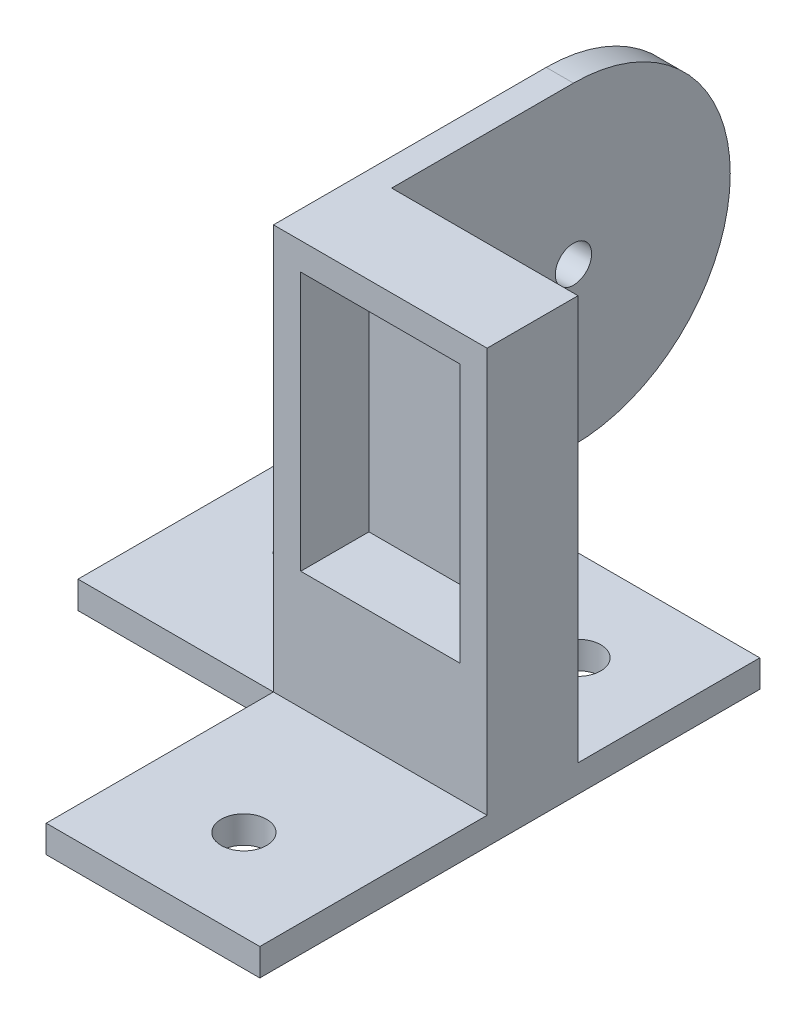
ISO-10303-21;
HEADER;
FILE_DESCRIPTION(('STEP AP214'),'2;1');
FILE_NAME('part.step','',(''),(''),'','','');
FILE_SCHEMA(('AUTOMOTIVE_DESIGN { 1 0 10303 214 1 1 1 1 }'));
ENDSEC;
DATA;
#1=APPLICATION_CONTEXT('core data for automotive mechanical design processes');
#2=APPLICATION_PROTOCOL_DEFINITION('international standard','automotive_design',2000,#1);
#3=PRODUCT_CONTEXT('',#1,'mechanical');
#4=PRODUCT('Part','Part','',(#3));
#5=PRODUCT_RELATED_PRODUCT_CATEGORY('part','',(#4));
#6=PRODUCT_DEFINITION_FORMATION('','',#4);
#7=PRODUCT_DEFINITION_CONTEXT('part definition',#1,'design');
#8=PRODUCT_DEFINITION('design','',#6,#7);
#9=PRODUCT_DEFINITION_SHAPE('','',#8);
#10=(LENGTH_UNIT() NAMED_UNIT(*) SI_UNIT(.MILLI.,.METRE.));
#11=(NAMED_UNIT(*) PLANE_ANGLE_UNIT() SI_UNIT($,.RADIAN.));
#12=(NAMED_UNIT(*) SI_UNIT($,.STERADIAN.) SOLID_ANGLE_UNIT());
#13=UNCERTAINTY_MEASURE_WITH_UNIT(LENGTH_MEASURE(1.E-05),#10,'distance_accuracy_value','');
#14=(GEOMETRIC_REPRESENTATION_CONTEXT(3) GLOBAL_UNCERTAINTY_ASSIGNED_CONTEXT((#13)) GLOBAL_UNIT_ASSIGNED_CONTEXT((#10,
#11,#12)) REPRESENTATION_CONTEXT('',''));
#15=CARTESIAN_POINT('',(0.,0.,0.));
#16=DIRECTION('',(0.,0.,1.));
#17=DIRECTION('',(1.,0.,0.));
#18=AXIS2_PLACEMENT_3D('',#15,#16,#17);
#19=CARTESIAN_POINT('',(-8.75,14.5,10.));
#20=DIRECTION('',(1.,0.,0.));
#21=DIRECTION('',(0.,1.,0.));
#22=AXIS2_PLACEMENT_3D('',#19,#20,#21);
#23=PLANE('',#22);
#24=CARTESIAN_POINT('',(-8.75,0.249999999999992,-20.));
#25=DIRECTION('',(1.,0.,0.));
#26=DIRECTION('',(0.,1.,0.));
#27=AXIS2_PLACEMENT_3D('',#24,#25,#26);
#28=CIRCLE('',#27,2.);
#29=CARTESIAN_POINT('',(-8.74999999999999,-1.75000000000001,-20.));
#30=VERTEX_POINT('',#29);
#31=EDGE_CURVE('E267',#30,#30,#28,.F.);
#32=ORIENTED_EDGE('',*,*,#31,.T.);
#33=EDGE_LOOP('',(#32));
#34=FACE_BOUND('',#33,.T.);
#35=DIRECTION('',(0.,1.,0.));
#36=VECTOR('',#35,1.);
#37=CARTESIAN_POINT('',(-8.75,17.5,0.));
#38=LINE('',#37,#36);
#39=CARTESIAN_POINT('',(-8.74999999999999,-27.,0.));
#40=VERTEX_POINT('',#39);
#41=CARTESIAN_POINT('',(-8.75,17.5,0.));
#42=VERTEX_POINT('',#41);
#43=EDGE_CURVE('E11',#40,#42,#38,.T.);
#44=ORIENTED_EDGE('',*,*,#43,.F.);
#45=DIRECTION('',(0.,0.,1.));
#46=VECTOR('',#45,1.);
#47=CARTESIAN_POINT('',(-8.75,-27.,-20.));
#48=LINE('',#47,#46);
#49=CARTESIAN_POINT('',(-8.75,-27.,-20.));
#50=VERTEX_POINT('',#49);
#51=EDGE_CURVE('E252',#50,#40,#48,.T.);
#52=ORIENTED_EDGE('',*,*,#51,.F.);
#53=DIRECTION('',(0.,1.,0.));
#54=VECTOR('',#53,1.);
#55=CARTESIAN_POINT('',(-8.75,-27.,-20.));
#56=LINE('',#55,#54);
#57=CARTESIAN_POINT('',(-8.75,-17.,-20.));
#58=VERTEX_POINT('',#57);
#59=EDGE_CURVE('E258',#50,#58,#56,.T.);
#60=ORIENTED_EDGE('',*,*,#59,.T.);
#61=CARTESIAN_POINT('',(-8.75,0.249999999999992,-20.));
#62=DIRECTION('',(1.,0.,0.));
#63=DIRECTION('',(0.,1.,0.));
#64=AXIS2_PLACEMENT_3D('',#61,#62,#63);
#65=CIRCLE('',#64,17.25);
#66=CARTESIAN_POINT('',(-8.74999999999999,17.5,-20.));
#67=VERTEX_POINT('',#66);
#68=EDGE_CURVE('E263',#67,#58,#65,.F.);
#69=ORIENTED_EDGE('',*,*,#68,.F.);
#70=DIRECTION('',(0.,0.,-1.));
#71=VECTOR('',#70,1.);
#72=CARTESIAN_POINT('',(-8.75,17.5,0.));
#73=LINE('',#72,#71);
#74=EDGE_CURVE('E275',#42,#67,#73,.T.);
#75=ORIENTED_EDGE('',*,*,#74,.F.);
#76=EDGE_LOOP('',(#44,#52,#60,#69,#75));
#77=FACE_BOUND('',#76,.T.);
#78=ADVANCED_FACE('F35',(#34,#77),#23,.T.);
#79=CARTESIAN_POINT('',(0.,0.,0.));
#80=DIRECTION('',(0.,0.,-1.));
#81=DIRECTION('',(-1.,0.,0.));
#82=AXIS2_PLACEMENT_3D('',#79,#80,#81);
#83=PLANE('',#82);
#84=DIRECTION('',(0.,1.,0.));
#85=VECTOR('',#84,1.);
#86=CARTESIAN_POINT('',(11.75,17.5,0.));
#87=LINE('',#86,#85);
#88=CARTESIAN_POINT('',(11.75,-27.,0.));
#89=VERTEX_POINT('',#88);
#90=CARTESIAN_POINT('',(11.75,17.5,0.));
#91=VERTEX_POINT('',#90);
#92=EDGE_CURVE('E301',#89,#91,#87,.T.);
#93=ORIENTED_EDGE('',*,*,#92,.F.);
#94=DIRECTION('',(1.,0.,0.));
#95=VECTOR('',#94,1.);
#96=CARTESIAN_POINT('',(-8.74999999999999,-27.,0.));
#97=LINE('',#96,#95);
#98=EDGE_CURVE('E255',#40,#89,#97,.T.);
#99=ORIENTED_EDGE('',*,*,#98,.F.);
#100=ORIENTED_EDGE('',*,*,#43,.T.);
#101=DIRECTION('',(-1.,0.,0.));
#102=VECTOR('',#101,1.);
#103=CARTESIAN_POINT('',(-11.75,17.5,0.));
#104=LINE('',#103,#102);
#105=EDGE_CURVE('E296',#91,#42,#104,.T.);
#106=ORIENTED_EDGE('',*,*,#105,.F.);
#107=EDGE_LOOP('',(#93,#99,#100,#106));
#108=FACE_BOUND('',#107,.T.);
#109=ADVANCED_FACE('F356',(#108),#83,.T.);
#110=CARTESIAN_POINT('',(0.,0.,10.));
#111=DIRECTION('',(0.,0.,-1.));
#112=DIRECTION('',(-1.,0.,0.));
#113=AXIS2_PLACEMENT_3D('',#110,#111,#112);
#114=PLANE('',#113);
#115=DIRECTION('',(-1.,0.,0.));
#116=VECTOR('',#115,1.);
#117=CARTESIAN_POINT('',(-11.75,17.5,10.));
#118=LINE('',#117,#116);
#119=CARTESIAN_POINT('',(11.75,17.5,10.));
#120=VERTEX_POINT('',#119);
#121=CARTESIAN_POINT('',(-11.75,17.5,10.));
#122=VERTEX_POINT('',#121);
#123=EDGE_CURVE('E297',#120,#122,#118,.T.);
#124=ORIENTED_EDGE('',*,*,#123,.T.);
#125=DIRECTION('',(0.,-1.,0.));
#126=VECTOR('',#125,1.);
#127=CARTESIAN_POINT('',(-11.75,17.5,10.));
#128=LINE('',#127,#126);
#129=CARTESIAN_POINT('',(-11.75,-27.,10.));
#130=VERTEX_POINT('',#129);
#131=EDGE_CURVE('E300',#122,#130,#128,.T.);
#132=ORIENTED_EDGE('',*,*,#131,.T.);
#133=DIRECTION('',(-1.,0.,0.));
#134=VECTOR('',#133,1.);
#135=CARTESIAN_POINT('',(11.75,-27.,10.));
#136=LINE('',#135,#134);
#137=CARTESIAN_POINT('',(11.75,-27.,10.));
#138=VERTEX_POINT('',#137);
#139=EDGE_CURVE('E246',#138,#130,#136,.T.);
#140=ORIENTED_EDGE('',*,*,#139,.F.);
#141=DIRECTION('',(0.,1.,0.));
#142=VECTOR('',#141,1.);
#143=CARTESIAN_POINT('',(11.75,17.5,10.));
#144=LINE('',#143,#142);
#145=EDGE_CURVE('E303',#138,#120,#144,.T.);
#146=ORIENTED_EDGE('',*,*,#145,.T.);
#147=EDGE_LOOP('',(#124,#132,#140,#146));
#148=FACE_BOUND('',#147,.T.);
#149=DIRECTION('',(0.,-1.,0.));
#150=VECTOR('',#149,1.);
#151=CARTESIAN_POINT('',(-8.75,14.5,10.));
#152=LINE('',#151,#150);
#153=CARTESIAN_POINT('',(-8.75,14.5,10.));
#154=VERTEX_POINT('',#153);
#155=CARTESIAN_POINT('',(-8.75,-14.,10.));
#156=VERTEX_POINT('',#155);
#157=EDGE_CURVE('E274',#154,#156,#152,.T.);
#158=ORIENTED_EDGE('',*,*,#157,.F.);
#159=DIRECTION('',(-1.,0.,0.));
#160=VECTOR('',#159,1.);
#161=CARTESIAN_POINT('',(-8.75,14.5,10.));
#162=LINE('',#161,#160);
#163=CARTESIAN_POINT('',(8.75,14.5,10.));
#164=VERTEX_POINT('',#163);
#165=EDGE_CURVE('E163',#164,#154,#162,.T.);
#166=ORIENTED_EDGE('',*,*,#165,.F.);
#167=DIRECTION('',(0.,1.,0.));
#168=VECTOR('',#167,1.);
#169=CARTESIAN_POINT('',(8.75,14.5,10.));
#170=LINE('',#169,#168);
#171=CARTESIAN_POINT('',(8.75,-14.,10.));
#172=VERTEX_POINT('',#171);
#173=EDGE_CURVE('E288',#172,#164,#170,.T.);
#174=ORIENTED_EDGE('',*,*,#173,.F.);
#175=DIRECTION('',(1.,0.,0.));
#176=VECTOR('',#175,1.);
#177=CARTESIAN_POINT('',(-8.75,-14.,10.));
#178=LINE('',#177,#176);
#179=EDGE_CURVE('E286',#156,#172,#178,.T.);
#180=ORIENTED_EDGE('',*,*,#179,.F.);
#181=EDGE_LOOP('',(#158,#166,#174,#180));
#182=FACE_BOUND('',#181,.T.);
#183=ADVANCED_FACE('F353',(#148,#182),#114,.F.);
#184=CARTESIAN_POINT('',(-11.75,17.5,10.));
#185=DIRECTION('',(0.,-1.,0.));
#186=DIRECTION('',(0.,0.,-1.));
#187=AXIS2_PLACEMENT_3D('',#184,#185,#186);
#188=PLANE('',#187);
#189=ORIENTED_EDGE('',*,*,#105,.T.);
#190=ORIENTED_EDGE('',*,*,#74,.T.);
#191=DIRECTION('',(-1.,0.,0.));
#192=VECTOR('',#191,1.);
#193=CARTESIAN_POINT('',(42.0221626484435,17.5,-20.));
#194=LINE('',#193,#192);
#195=CARTESIAN_POINT('',(-11.75,17.5,-20.));
#196=VERTEX_POINT('',#195);
#197=EDGE_CURVE('E271',#67,#196,#194,.T.);
#198=ORIENTED_EDGE('',*,*,#197,.T.);
#199=DIRECTION('',(0.,0.,-1.));
#200=VECTOR('',#199,1.);
#201=CARTESIAN_POINT('',(-11.75,17.5,10.));
#202=LINE('',#201,#200);
#203=EDGE_CURVE('E39',#122,#196,#202,.T.);
#204=ORIENTED_EDGE('',*,*,#203,.F.);
#205=ORIENTED_EDGE('',*,*,#123,.F.);
#206=DIRECTION('',(0.,0.,-1.));
#207=VECTOR('',#206,1.);
#208=CARTESIAN_POINT('',(11.75,17.5,10.));
#209=LINE('',#208,#207);
#210=EDGE_CURVE('E305',#120,#91,#209,.T.);
#211=ORIENTED_EDGE('',*,*,#210,.T.);
#212=EDGE_LOOP('',(#189,#190,#198,#204,#205,#211));
#213=FACE_BOUND('',#212,.T.);
#214=ADVANCED_FACE('F37',(#213),#188,.F.);
#215=CARTESIAN_POINT('',(-11.75,17.5,10.));
#216=DIRECTION('',(1.,0.,0.));
#217=DIRECTION('',(0.,1.,0.));
#218=AXIS2_PLACEMENT_3D('',#215,#216,#217);
#219=PLANE('',#218);
#220=ORIENTED_EDGE('',*,*,#203,.T.);
#221=CARTESIAN_POINT('',(-11.75,0.249999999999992,-20.));
#222=DIRECTION('',(-1.,0.,0.));
#223=DIRECTION('',(0.,-1.,0.));
#224=AXIS2_PLACEMENT_3D('',#221,#222,#223);
#225=CIRCLE('',#224,17.25);
#226=CARTESIAN_POINT('',(-11.75,-17.,-20.));
#227=VERTEX_POINT('',#226);
#228=EDGE_CURVE('E264',#196,#227,#225,.T.);
#229=ORIENTED_EDGE('',*,*,#228,.T.);
#230=DIRECTION('',(0.,1.,0.));
#231=VECTOR('',#230,1.);
#232=CARTESIAN_POINT('',(-11.75,-27.,-20.));
#233=LINE('',#232,#231);
#234=CARTESIAN_POINT('',(-11.75,-27.,-20.));
#235=VERTEX_POINT('',#234);
#236=EDGE_CURVE('E261',#235,#227,#233,.T.);
#237=ORIENTED_EDGE('',*,*,#236,.F.);
#238=DIRECTION('',(0.,0.,-1.));
#239=VECTOR('',#238,1.);
#240=CARTESIAN_POINT('',(-11.75,-27.,10.));
#241=LINE('',#240,#239);
#242=EDGE_CURVE('E249',#130,#235,#241,.T.);
#243=ORIENTED_EDGE('',*,*,#242,.F.);
#244=ORIENTED_EDGE('',*,*,#131,.F.);
#245=EDGE_LOOP('',(#220,#229,#237,#243,#244));
#246=FACE_BOUND('',#245,.T.);
#247=CARTESIAN_POINT('',(-11.75,0.249999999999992,-20.));
#248=DIRECTION('',(-1.,0.,0.));
#249=DIRECTION('',(0.,-1.,0.));
#250=AXIS2_PLACEMENT_3D('',#247,#248,#249);
#251=CIRCLE('',#250,2.);
#252=CARTESIAN_POINT('',(-11.75,-1.75000000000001,-20.));
#253=VERTEX_POINT('',#252);
#254=EDGE_CURVE('E268',#253,#253,#251,.T.);
#255=ORIENTED_EDGE('',*,*,#254,.F.);
#256=EDGE_LOOP('',(#255));
#257=FACE_BOUND('',#256,.T.);
#258=ADVANCED_FACE('F315',(#246,#257),#219,.F.);
#259=CARTESIAN_POINT('',(11.75,17.5,10.));
#260=DIRECTION('',(-1.,0.,0.));
#261=DIRECTION('',(0.,-1.,0.));
#262=AXIS2_PLACEMENT_3D('',#259,#260,#261);
#263=PLANE('',#262);
#264=ORIENTED_EDGE('',*,*,#92,.T.);
#265=ORIENTED_EDGE('',*,*,#210,.F.);
#266=ORIENTED_EDGE('',*,*,#145,.F.);
#267=DIRECTION('',(0.,0.,-1.));
#268=VECTOR('',#267,1.);
#269=CARTESIAN_POINT('',(11.75,-27.,0.));
#270=LINE('',#269,#268);
#271=CARTESIAN_POINT('',(11.75,-27.,35.));
#272=VERTEX_POINT('',#271);
#273=EDGE_CURVE('E215',#272,#138,#270,.T.);
#274=ORIENTED_EDGE('',*,*,#273,.F.);
#275=DIRECTION('',(0.,1.,0.));
#276=VECTOR('',#275,1.);
#277=CARTESIAN_POINT('',(11.75,-30.,35.));
#278=LINE('',#277,#276);
#279=CARTESIAN_POINT('',(11.75,-30.,35.));
#280=VERTEX_POINT('',#279);
#281=EDGE_CURVE('E244',#280,#272,#278,.T.);
#282=ORIENTED_EDGE('',*,*,#281,.F.);
#283=DIRECTION('',(0.,0.,-1.));
#284=VECTOR('',#283,1.);
#285=CARTESIAN_POINT('',(11.75,-30.,0.));
#286=LINE('',#285,#284);
#287=CARTESIAN_POINT('',(11.75,-30.,-20.));
#288=VERTEX_POINT('',#287);
#289=EDGE_CURVE('E197',#280,#288,#286,.T.);
#290=ORIENTED_EDGE('',*,*,#289,.T.);
#291=DIRECTION('',(0.,1.,0.));
#292=VECTOR('',#291,1.);
#293=CARTESIAN_POINT('',(11.75,-30.,-20.));
#294=LINE('',#293,#292);
#295=CARTESIAN_POINT('',(11.75,-27.,-20.));
#296=VERTEX_POINT('',#295);
#297=EDGE_CURVE('E214',#288,#296,#294,.T.);
#298=ORIENTED_EDGE('',*,*,#297,.T.);
#299=EDGE_CURVE('E189',#89,#296,#270,.T.);
#300=ORIENTED_EDGE('',*,*,#299,.F.);
#301=EDGE_LOOP('',(#264,#265,#266,#274,#282,#290,#298,#300));
#302=FACE_BOUND('',#301,.T.);
#303=ADVANCED_FACE('F335',(#302),#263,.F.);
#304=DIRECTION('',(0.,1.,0.));
#305=VECTOR('',#304,1.);
#306=CARTESIAN_POINT('',(-8.75,-14.,2.5));
#307=LINE('',#306,#305);
#308=CARTESIAN_POINT('',(-8.75,-14.,2.5));
#309=VERTEX_POINT('',#308);
#310=CARTESIAN_POINT('',(-8.75,14.5,2.5));
#311=VERTEX_POINT('',#310);
#312=EDGE_CURVE('E169',#309,#311,#307,.T.);
#313=ORIENTED_EDGE('',*,*,#312,.T.);
#314=DIRECTION('',(0.,0.,-1.));
#315=VECTOR('',#314,1.);
#316=CARTESIAN_POINT('',(-8.75,14.5,10.));
#317=LINE('',#316,#315);
#318=EDGE_CURVE('E157',#154,#311,#317,.T.);
#319=ORIENTED_EDGE('',*,*,#318,.F.);
#320=ORIENTED_EDGE('',*,*,#157,.T.);
#321=DIRECTION('',(0.,0.,-1.));
#322=VECTOR('',#321,1.);
#323=CARTESIAN_POINT('',(-8.75,-14.,10.));
#324=LINE('',#323,#322);
#325=EDGE_CURVE('E171',#156,#309,#324,.T.);
#326=ORIENTED_EDGE('',*,*,#325,.T.);
#327=EDGE_LOOP('',(#313,#319,#320,#326));
#328=FACE_BOUND('',#327,.T.);
#329=ADVANCED_FACE('F170',(#328),#23,.T.);
#330=CARTESIAN_POINT('',(-8.75,-14.,10.));
#331=DIRECTION('',(0.,1.,0.));
#332=DIRECTION('',(-1.,0.,0.));
#333=AXIS2_PLACEMENT_3D('',#330,#331,#332);
#334=PLANE('',#333);
#335=DIRECTION('',(-1.,0.,0.));
#336=VECTOR('',#335,1.);
#337=CARTESIAN_POINT('',(8.75,-14.,2.5));
#338=LINE('',#337,#336);
#339=CARTESIAN_POINT('',(8.75,-14.,2.5));
#340=VERTEX_POINT('',#339);
#341=EDGE_CURVE('E51',#340,#309,#338,.T.);
#342=ORIENTED_EDGE('',*,*,#341,.T.);
#343=ORIENTED_EDGE('',*,*,#325,.F.);
#344=ORIENTED_EDGE('',*,*,#179,.T.);
#345=DIRECTION('',(0.,0.,-1.));
#346=VECTOR('',#345,1.);
#347=CARTESIAN_POINT('',(8.75,-14.,10.));
#348=LINE('',#347,#346);
#349=EDGE_CURVE('E293',#172,#340,#348,.T.);
#350=ORIENTED_EDGE('',*,*,#349,.T.);
#351=EDGE_LOOP('',(#342,#343,#344,#350));
#352=FACE_BOUND('',#351,.T.);
#353=ADVANCED_FACE('F534',(#352),#334,.T.);
#354=CARTESIAN_POINT('',(8.75,14.5,10.));
#355=DIRECTION('',(-1.,0.,0.));
#356=DIRECTION('',(0.,-1.,0.));
#357=AXIS2_PLACEMENT_3D('',#354,#355,#356);
#358=PLANE('',#357);
#359=DIRECTION('',(0.,-1.,0.));
#360=VECTOR('',#359,1.);
#361=CARTESIAN_POINT('',(8.75,-14.,2.5));
#362=LINE('',#361,#360);
#363=CARTESIAN_POINT('',(8.75,14.5,2.5));
#364=VERTEX_POINT('',#363);
#365=EDGE_CURVE('E59',#364,#340,#362,.T.);
#366=ORIENTED_EDGE('',*,*,#365,.T.);
#367=ORIENTED_EDGE('',*,*,#349,.F.);
#368=ORIENTED_EDGE('',*,*,#173,.T.);
#369=DIRECTION('',(0.,0.,-1.));
#370=VECTOR('',#369,1.);
#371=CARTESIAN_POINT('',(8.75,14.5,10.));
#372=LINE('',#371,#370);
#373=EDGE_CURVE('E166',#164,#364,#372,.T.);
#374=ORIENTED_EDGE('',*,*,#373,.T.);
#375=EDGE_LOOP('',(#366,#367,#368,#374));
#376=FACE_BOUND('',#375,.T.);
#377=ADVANCED_FACE('F544',(#376),#358,.T.);
#378=CARTESIAN_POINT('',(-8.75,14.5,10.));
#379=DIRECTION('',(0.,-1.,0.));
#380=DIRECTION('',(1.,0.,0.));
#381=AXIS2_PLACEMENT_3D('',#378,#379,#380);
#382=PLANE('',#381);
#383=DIRECTION('',(1.,0.,0.));
#384=VECTOR('',#383,1.);
#385=CARTESIAN_POINT('',(8.75,14.5,2.5));
#386=LINE('',#385,#384);
#387=EDGE_CURVE('E161',#311,#364,#386,.T.);
#388=ORIENTED_EDGE('',*,*,#387,.T.);
#389=ORIENTED_EDGE('',*,*,#373,.F.);
#390=ORIENTED_EDGE('',*,*,#165,.T.);
#391=ORIENTED_EDGE('',*,*,#318,.T.);
#392=EDGE_LOOP('',(#388,#389,#390,#391));
#393=FACE_BOUND('',#392,.T.);
#394=ADVANCED_FACE('F159',(#393),#382,.T.);
#395=CARTESIAN_POINT('',(42.0221626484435,0.249999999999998,-20.));
#396=DIRECTION('',(-1.,0.,0.));
#397=DIRECTION('',(0.,-1.,0.));
#398=AXIS2_PLACEMENT_3D('',#395,#396,#397);
#399=CYLINDRICAL_SURFACE('',#398,17.25);
#400=ORIENTED_EDGE('',*,*,#197,.F.);
#401=ORIENTED_EDGE('',*,*,#68,.T.);
#402=DIRECTION('',(-1.,0.,0.));
#403=VECTOR('',#402,1.);
#404=CARTESIAN_POINT('',(42.0221626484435,-17.,-20.));
#405=LINE('',#404,#403);
#406=EDGE_CURVE('E277',#58,#227,#405,.T.);
#407=ORIENTED_EDGE('',*,*,#406,.T.);
#408=ORIENTED_EDGE('',*,*,#228,.F.);
#409=EDGE_LOOP('',(#400,#401,#407,#408));
#410=FACE_BOUND('',#409,.T.);
#411=ADVANCED_FACE('F321',(#410),#399,.T.);
#412=CARTESIAN_POINT('',(42.0221626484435,0.249999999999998,-20.));
#413=DIRECTION('',(-1.,0.,0.));
#414=DIRECTION('',(0.,-1.,0.));
#415=AXIS2_PLACEMENT_3D('',#412,#413,#414);
#416=CYLINDRICAL_SURFACE('',#415,2.);
#417=CARTESIAN_POINT('',(-11.75,-1.75000000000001,-20.));
#418=CARTESIAN_POINT('',(-11.71875,-1.75000000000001,-20.));
#419=CARTESIAN_POINT('',(-11.6875,-1.75000000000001,-20.));
#420=CARTESIAN_POINT('',(-11.625,-1.75000000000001,-20.));
#421=CARTESIAN_POINT('',(-11.59375,-1.75000000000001,-20.));
#422=CARTESIAN_POINT('',(-11.53125,-1.75000000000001,-20.));
#423=CARTESIAN_POINT('',(-11.5,-1.75000000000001,-20.));
#424=CARTESIAN_POINT('',(-11.4375,-1.75000000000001,-20.));
#425=CARTESIAN_POINT('',(-11.40625,-1.75000000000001,-20.));
#426=CARTESIAN_POINT('',(-11.34375,-1.75000000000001,-20.));
#427=CARTESIAN_POINT('',(-11.3125,-1.75000000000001,-20.));
#428=CARTESIAN_POINT('',(-11.25,-1.75000000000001,-20.));
#429=CARTESIAN_POINT('',(-11.21875,-1.75000000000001,-20.));
#430=CARTESIAN_POINT('',(-11.15625,-1.75000000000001,-20.));
#431=CARTESIAN_POINT('',(-11.125,-1.75000000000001,-20.));
#432=CARTESIAN_POINT('',(-11.0625,-1.75000000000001,-20.));
#433=CARTESIAN_POINT('',(-11.03125,-1.75000000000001,-20.));
#434=CARTESIAN_POINT('',(-10.96875,-1.75000000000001,-20.));
#435=CARTESIAN_POINT('',(-10.9375,-1.75000000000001,-20.));
#436=CARTESIAN_POINT('',(-10.875,-1.75000000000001,-20.));
#437=CARTESIAN_POINT('',(-10.84375,-1.75000000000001,-20.));
#438=CARTESIAN_POINT('',(-10.78125,-1.75000000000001,-20.));
#439=CARTESIAN_POINT('',(-10.75,-1.75000000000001,-20.));
#440=CARTESIAN_POINT('',(-10.6875,-1.75000000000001,-20.));
#441=CARTESIAN_POINT('',(-10.65625,-1.75000000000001,-20.));
#442=CARTESIAN_POINT('',(-10.59375,-1.75000000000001,-20.));
#443=CARTESIAN_POINT('',(-10.5625,-1.75000000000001,-20.));
#444=CARTESIAN_POINT('',(-10.5,-1.75000000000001,-20.));
#445=CARTESIAN_POINT('',(-10.46875,-1.75000000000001,-20.));
#446=CARTESIAN_POINT('',(-10.40625,-1.75000000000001,-20.));
#447=CARTESIAN_POINT('',(-10.375,-1.75000000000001,-20.));
#448=CARTESIAN_POINT('',(-10.3125,-1.75000000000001,-20.));
#449=CARTESIAN_POINT('',(-10.28125,-1.75000000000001,-20.));
#450=CARTESIAN_POINT('',(-10.21875,-1.75000000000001,-20.));
#451=CARTESIAN_POINT('',(-10.1875,-1.75000000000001,-20.));
#452=CARTESIAN_POINT('',(-10.125,-1.75000000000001,-20.));
#453=CARTESIAN_POINT('',(-10.09375,-1.75000000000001,-20.));
#454=CARTESIAN_POINT('',(-10.03125,-1.75000000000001,-20.));
#455=CARTESIAN_POINT('',(-10.,-1.75000000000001,-20.));
#456=CARTESIAN_POINT('',(-9.9375,-1.75000000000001,-20.));
#457=CARTESIAN_POINT('',(-9.90625,-1.75000000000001,-20.));
#458=CARTESIAN_POINT('',(-9.84374999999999,-1.75000000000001,-20.));
#459=CARTESIAN_POINT('',(-9.81249999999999,-1.75000000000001,-20.));
#460=CARTESIAN_POINT('',(-9.74999999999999,-1.75000000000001,-20.));
#461=CARTESIAN_POINT('',(-9.71874999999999,-1.75000000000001,-20.));
#462=CARTESIAN_POINT('',(-9.65625,-1.75000000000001,-20.));
#463=CARTESIAN_POINT('',(-9.625,-1.75000000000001,-20.));
#464=CARTESIAN_POINT('',(-9.5625,-1.75000000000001,-20.));
#465=CARTESIAN_POINT('',(-9.53125,-1.75000000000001,-20.));
#466=CARTESIAN_POINT('',(-9.46874999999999,-1.75000000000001,-20.));
#467=CARTESIAN_POINT('',(-9.43749999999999,-1.75000000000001,-20.));
#468=CARTESIAN_POINT('',(-9.37499999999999,-1.75000000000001,-20.));
#469=CARTESIAN_POINT('',(-9.34374999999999,-1.75000000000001,-20.));
#470=CARTESIAN_POINT('',(-9.28125,-1.75000000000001,-20.));
#471=CARTESIAN_POINT('',(-9.25,-1.75000000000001,-20.));
#472=CARTESIAN_POINT('',(-9.1875,-1.75000000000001,-20.));
#473=CARTESIAN_POINT('',(-9.15625,-1.75000000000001,-20.));
#474=CARTESIAN_POINT('',(-9.09374999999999,-1.75000000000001,-20.));
#475=CARTESIAN_POINT('',(-9.06249999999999,-1.75000000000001,-20.));
#476=CARTESIAN_POINT('',(-8.99999999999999,-1.75000000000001,-20.));
#477=CARTESIAN_POINT('',(-8.96874999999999,-1.75000000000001,-20.));
#478=CARTESIAN_POINT('',(-8.90625,-1.75000000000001,-20.));
#479=CARTESIAN_POINT('',(-8.875,-1.75000000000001,-20.));
#480=CARTESIAN_POINT('',(-8.8125,-1.75000000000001,-20.));
#481=CARTESIAN_POINT('',(-8.78125,-1.75000000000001,-20.));
#482=CARTESIAN_POINT('',(-8.74999999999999,-1.75000000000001,-20.));
#483=B_SPLINE_CURVE_WITH_KNOTS('',3,(#417,#418,#419,#420,#421,#422,#423,#424,#425,#426,#427,
#428,#429,#430,#431,#432,#433,#434,#435,#436,#437,#438,#439,#440,#441,#442,#443,#444,#445,#446,
#447,#448,#449,#450,#451,#452,#453,#454,#455,#456,#457,#458,#459,#460,#461,#462,#463,#464,#465,
#466,#467,#468,#469,#470,#471,#472,#473,#474,#475,#476,#477,#478,#479,#480,#481,#482),
.UNSPECIFIED.,.F.,.F.,(4,2,2,2,2,2,2,2,2,2,2,2,2,2,2,2,2,2,2,2,2,2,2,2,2,2,2,2,2,2,2,2,4),(0.,
0.0937500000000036,0.1875,0.281249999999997,0.375,0.468750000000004,0.5625,0.656249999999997,
0.750000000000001,0.843750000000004,0.937500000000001,1.03125,1.125,1.21875,1.3125,1.40625,1.5,
1.59375,1.6875,1.78125,1.875,1.96875000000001,2.0625,2.15625,2.25,2.34375000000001,2.4375,
2.53125,2.625,2.71875000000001,2.8125,2.90625,3.),.UNSPECIFIED.);
#484=EDGE_CURVE('BSEAM409',#253,#30,#483,.T.);
#485=ORIENTED_EDGE('',*,*,#254,.T.);
#486=ORIENTED_EDGE('',*,*,#31,.F.);
#487=ORIENTED_EDGE('',*,*,#484,.T.);
#488=ORIENTED_EDGE('',*,*,#484,.F.);
#489=EDGE_LOOP('',(#485,#487,#486,#488));
#490=FACE_BOUND('',#489,.T.);
#491=ADVANCED_FACE('F409',(#490),#416,.F.);
#492=CARTESIAN_POINT('',(-11.75,-27.,-20.));
#493=DIRECTION('',(0.,0.,1.));
#494=DIRECTION('',(1.,0.,0.));
#495=AXIS2_PLACEMENT_3D('',#492,#493,#494);
#496=PLANE('',#495);
#497=ORIENTED_EDGE('',*,*,#406,.F.);
#498=ORIENTED_EDGE('',*,*,#59,.F.);
#499=DIRECTION('',(-1.,0.,0.));
#500=VECTOR('',#499,1.);
#501=CARTESIAN_POINT('',(0.,-27.,-20.));
#502=LINE('',#501,#500);
#503=EDGE_CURVE('E201',#296,#50,#502,.T.);
#504=ORIENTED_EDGE('',*,*,#503,.F.);
#505=ORIENTED_EDGE('',*,*,#297,.F.);
#506=DIRECTION('',(-1.,0.,0.));
#507=VECTOR('',#506,1.);
#508=CARTESIAN_POINT('',(0.,-30.,-20.));
#509=LINE('',#508,#507);
#510=CARTESIAN_POINT('',(-33.25,-30.,-20.));
#511=VERTEX_POINT('',#510);
#512=EDGE_CURVE('E211',#288,#511,#509,.T.);
#513=ORIENTED_EDGE('',*,*,#512,.T.);
#514=DIRECTION('',(0.,1.,0.));
#515=VECTOR('',#514,1.);
#516=CARTESIAN_POINT('',(-33.25,-30.,-20.));
#517=LINE('',#516,#515);
#518=CARTESIAN_POINT('',(-33.25,-27.,-20.));
#519=VERTEX_POINT('',#518);
#520=EDGE_CURVE('E235',#511,#519,#517,.T.);
#521=ORIENTED_EDGE('',*,*,#520,.T.);
#522=EDGE_CURVE('E230',#235,#519,#502,.T.);
#523=ORIENTED_EDGE('',*,*,#522,.F.);
#524=ORIENTED_EDGE('',*,*,#236,.T.);
#525=EDGE_LOOP('',(#497,#498,#504,#505,#513,#521,#523,#524));
#526=FACE_BOUND('',#525,.T.);
#527=ADVANCED_FACE('F323',(#526),#496,.F.);
#528=CARTESIAN_POINT('',(0.,-27.,0.));
#529=DIRECTION('',(0.,-1.,0.));
#530=DIRECTION('',(0.,0.,-1.));
#531=AXIS2_PLACEMENT_3D('',#528,#529,#530);
#532=PLANE('',#531);
#533=CARTESIAN_POINT('',(-23.25,-27.,-4.99919642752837));
#534=DIRECTION('',(0.,-1.,0.));
#535=DIRECTION('',(0.,0.,-1.));
#536=AXIS2_PLACEMENT_3D('',#533,#534,#535);
#537=CIRCLE('',#536,2.5);
#538=CARTESIAN_POINT('',(-23.25,-27.,-7.49919642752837));
#539=VERTEX_POINT('',#538);
#540=EDGE_CURVE('E185',#539,#539,#537,.F.);
#541=ORIENTED_EDGE('',*,*,#540,.F.);
#542=EDGE_LOOP('',(#541));
#543=FACE_BOUND('',#542,.T.);
#544=CARTESIAN_POINT('',(0.,-27.,25.));
#545=DIRECTION('',(0.,-1.,0.));
#546=DIRECTION('',(0.,0.,-1.));
#547=AXIS2_PLACEMENT_3D('',#544,#545,#546);
#548=CIRCLE('',#547,2.5);
#549=CARTESIAN_POINT('',(0.,-27.,22.5));
#550=VERTEX_POINT('',#549);
#551=EDGE_CURVE('E178',#550,#550,#548,.F.);
#552=ORIENTED_EDGE('',*,*,#551,.F.);
#553=EDGE_LOOP('',(#552));
#554=FACE_BOUND('',#553,.T.);
#555=ORIENTED_EDGE('',*,*,#273,.T.);
#556=ORIENTED_EDGE('',*,*,#139,.T.);
#557=ORIENTED_EDGE('',*,*,#242,.T.);
#558=ORIENTED_EDGE('',*,*,#522,.T.);
#559=DIRECTION('',(0.,0.,1.));
#560=VECTOR('',#559,1.);
#561=CARTESIAN_POINT('',(-33.25,-27.,0.));
#562=LINE('',#561,#560);
#563=CARTESIAN_POINT('',(-33.25,-27.,10.0008035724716));
#564=VERTEX_POINT('',#563);
#565=EDGE_CURVE('E227',#519,#564,#562,.T.);
#566=ORIENTED_EDGE('',*,*,#565,.T.);
#567=DIRECTION('',(-1.,0.,0.));
#568=VECTOR('',#567,1.);
#569=CARTESIAN_POINT('',(0.,-27.,10.0008035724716));
#570=LINE('',#569,#568);
#571=CARTESIAN_POINT('',(-11.75,-27.,10.0008035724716));
#572=VERTEX_POINT('',#571);
#573=EDGE_CURVE('E224',#572,#564,#570,.T.);
#574=ORIENTED_EDGE('',*,*,#573,.F.);
#575=DIRECTION('',(0.,0.,1.));
#576=VECTOR('',#575,1.);
#577=CARTESIAN_POINT('',(-11.75,-27.,0.));
#578=LINE('',#577,#576);
#579=CARTESIAN_POINT('',(-11.75,-27.,35.));
#580=VERTEX_POINT('',#579);
#581=EDGE_CURVE('E221',#572,#580,#578,.T.);
#582=ORIENTED_EDGE('',*,*,#581,.T.);
#583=DIRECTION('',(-1.,0.,0.));
#584=VECTOR('',#583,1.);
#585=CARTESIAN_POINT('',(0.,-27.,35.));
#586=LINE('',#585,#584);
#587=EDGE_CURVE('E218',#272,#580,#586,.T.);
#588=ORIENTED_EDGE('',*,*,#587,.F.);
#589=EDGE_LOOP('',(#555,#556,#557,#558,#566,#574,#582,#588));
#590=FACE_BOUND('',#589,.T.);
#591=ADVANCED_FACE('F348',(#543,#554,#590),#532,.F.);
#592=CARTESIAN_POINT('',(1.75,-27.,-9.99999999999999));
#593=DIRECTION('',(0.,-1.,0.));
#594=DIRECTION('',(0.,0.,-1.));
#595=AXIS2_PLACEMENT_3D('',#592,#593,#594);
#596=CIRCLE('',#595,2.5);
#597=CARTESIAN_POINT('',(1.75,-27.,-12.5));
#598=VERTEX_POINT('',#597);
#599=EDGE_CURVE('E186',#598,#598,#596,.F.);
#600=ORIENTED_EDGE('',*,*,#599,.F.);
#601=EDGE_LOOP('',(#600));
#602=FACE_BOUND('',#601,.T.);
#603=ORIENTED_EDGE('',*,*,#503,.T.);
#604=ORIENTED_EDGE('',*,*,#51,.T.);
#605=ORIENTED_EDGE('',*,*,#98,.T.);
#606=ORIENTED_EDGE('',*,*,#299,.T.);
#607=EDGE_LOOP('',(#603,#604,#605,#606));
#608=FACE_BOUND('',#607,.T.);
#609=ADVANCED_FACE('F330',(#602,#608),#532,.F.);
#610=CARTESIAN_POINT('',(0.,-30.,35.));
#611=DIRECTION('',(0.,0.,-1.));
#612=DIRECTION('',(-1.,0.,0.));
#613=AXIS2_PLACEMENT_3D('',#610,#611,#612);
#614=PLANE('',#613);
#615=ORIENTED_EDGE('',*,*,#587,.T.);
#616=DIRECTION('',(0.,1.,0.));
#617=VECTOR('',#616,1.);
#618=CARTESIAN_POINT('',(-11.75,-30.,35.));
#619=LINE('',#618,#617);
#620=CARTESIAN_POINT('',(-11.75,-30.,35.));
#621=VERTEX_POINT('',#620);
#622=EDGE_CURVE('E242',#621,#580,#619,.T.);
#623=ORIENTED_EDGE('',*,*,#622,.F.);
#624=DIRECTION('',(-1.,0.,0.));
#625=VECTOR('',#624,1.);
#626=CARTESIAN_POINT('',(0.,-30.,35.));
#627=LINE('',#626,#625);
#628=EDGE_CURVE('E200',#280,#621,#627,.T.);
#629=ORIENTED_EDGE('',*,*,#628,.F.);
#630=ORIENTED_EDGE('',*,*,#281,.T.);
#631=EDGE_LOOP('',(#615,#623,#629,#630));
#632=FACE_BOUND('',#631,.T.);
#633=ADVANCED_FACE('F418',(#632),#614,.F.);
#634=CARTESIAN_POINT('',(-11.75,-30.,0.));
#635=DIRECTION('',(-1.,0.,0.));
#636=DIRECTION('',(0.,0.,1.));
#637=AXIS2_PLACEMENT_3D('',#634,#635,#636);
#638=PLANE('',#637);
#639=ORIENTED_EDGE('',*,*,#581,.F.);
#640=DIRECTION('',(0.,1.,0.));
#641=VECTOR('',#640,1.);
#642=CARTESIAN_POINT('',(-11.75,-30.,10.0008035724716));
#643=LINE('',#642,#641);
#644=CARTESIAN_POINT('',(-11.75,-30.,10.0008035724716));
#645=VERTEX_POINT('',#644);
#646=EDGE_CURVE('E240',#645,#572,#643,.T.);
#647=ORIENTED_EDGE('',*,*,#646,.F.);
#648=DIRECTION('',(0.,0.,1.));
#649=VECTOR('',#648,1.);
#650=CARTESIAN_POINT('',(-11.75,-30.,0.));
#651=LINE('',#650,#649);
#652=EDGE_CURVE('E203',#645,#621,#651,.T.);
#653=ORIENTED_EDGE('',*,*,#652,.T.);
#654=ORIENTED_EDGE('',*,*,#622,.T.);
#655=EDGE_LOOP('',(#639,#647,#653,#654));
#656=FACE_BOUND('',#655,.T.);
#657=ADVANCED_FACE('F423',(#656),#638,.T.);
#658=CARTESIAN_POINT('',(0.,-30.,10.0008035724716));
#659=DIRECTION('',(0.,0.,-1.));
#660=DIRECTION('',(-1.,0.,0.));
#661=AXIS2_PLACEMENT_3D('',#658,#659,#660);
#662=PLANE('',#661);
#663=ORIENTED_EDGE('',*,*,#573,.T.);
#664=DIRECTION('',(0.,1.,0.));
#665=VECTOR('',#664,1.);
#666=CARTESIAN_POINT('',(-33.25,-30.,10.0008035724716));
#667=LINE('',#666,#665);
#668=CARTESIAN_POINT('',(-33.25,-30.,10.0008035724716));
#669=VERTEX_POINT('',#668);
#670=EDGE_CURVE('E238',#669,#564,#667,.T.);
#671=ORIENTED_EDGE('',*,*,#670,.F.);
#672=DIRECTION('',(-1.,0.,0.));
#673=VECTOR('',#672,1.);
#674=CARTESIAN_POINT('',(0.,-30.,10.0008035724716));
#675=LINE('',#674,#673);
#676=EDGE_CURVE('E206',#645,#669,#675,.T.);
#677=ORIENTED_EDGE('',*,*,#676,.F.);
#678=ORIENTED_EDGE('',*,*,#646,.T.);
#679=EDGE_LOOP('',(#663,#671,#677,#678));
#680=FACE_BOUND('',#679,.T.);
#681=ADVANCED_FACE('F436',(#680),#662,.F.);
#682=CARTESIAN_POINT('',(-33.25,-30.,0.));
#683=DIRECTION('',(-1.,0.,0.));
#684=DIRECTION('',(0.,0.,1.));
#685=AXIS2_PLACEMENT_3D('',#682,#683,#684);
#686=PLANE('',#685);
#687=ORIENTED_EDGE('',*,*,#565,.F.);
#688=ORIENTED_EDGE('',*,*,#520,.F.);
#689=DIRECTION('',(0.,0.,1.));
#690=VECTOR('',#689,1.);
#691=CARTESIAN_POINT('',(-33.25,-30.,0.));
#692=LINE('',#691,#690);
#693=EDGE_CURVE('E208',#511,#669,#692,.T.);
#694=ORIENTED_EDGE('',*,*,#693,.T.);
#695=ORIENTED_EDGE('',*,*,#670,.T.);
#696=EDGE_LOOP('',(#687,#688,#694,#695));
#697=FACE_BOUND('',#696,.T.);
#698=ADVANCED_FACE('F346',(#697),#686,.T.);
#699=CARTESIAN_POINT('',(0.,-30.,0.));
#700=DIRECTION('',(0.,-1.,0.));
#701=DIRECTION('',(0.,0.,-1.));
#702=AXIS2_PLACEMENT_3D('',#699,#700,#701);
#703=PLANE('',#702);
#704=CARTESIAN_POINT('',(-23.25,-30.,-4.99919642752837));
#705=DIRECTION('',(0.,-1.,0.));
#706=DIRECTION('',(0.,0.,-1.));
#707=AXIS2_PLACEMENT_3D('',#704,#705,#706);
#708=CIRCLE('',#707,2.5);
#709=CARTESIAN_POINT('',(-23.25,-30.,-7.49919642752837));
#710=VERTEX_POINT('',#709);
#711=EDGE_CURVE('E182',#710,#710,#708,.T.);
#712=ORIENTED_EDGE('',*,*,#711,.F.);
#713=EDGE_LOOP('',(#712));
#714=FACE_BOUND('',#713,.T.);
#715=CARTESIAN_POINT('',(1.75,-30.,-9.99999999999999));
#716=DIRECTION('',(0.,-1.,0.));
#717=DIRECTION('',(0.,0.,-1.));
#718=AXIS2_PLACEMENT_3D('',#715,#716,#717);
#719=CIRCLE('',#718,2.5);
#720=CARTESIAN_POINT('',(1.75,-30.,-12.5));
#721=VERTEX_POINT('',#720);
#722=EDGE_CURVE('E190',#721,#721,#719,.T.);
#723=ORIENTED_EDGE('',*,*,#722,.F.);
#724=EDGE_LOOP('',(#723));
#725=FACE_BOUND('',#724,.T.);
#726=CARTESIAN_POINT('',(0.,-30.,25.));
#727=DIRECTION('',(0.,-1.,0.));
#728=DIRECTION('',(0.,0.,-1.));
#729=AXIS2_PLACEMENT_3D('',#726,#727,#728);
#730=CIRCLE('',#729,2.5);
#731=CARTESIAN_POINT('',(0.,-30.,22.5));
#732=VERTEX_POINT('',#731);
#733=EDGE_CURVE('E175',#732,#732,#730,.T.);
#734=ORIENTED_EDGE('',*,*,#733,.F.);
#735=EDGE_LOOP('',(#734));
#736=FACE_BOUND('',#735,.T.);
#737=ORIENTED_EDGE('',*,*,#289,.F.);
#738=ORIENTED_EDGE('',*,*,#628,.T.);
#739=ORIENTED_EDGE('',*,*,#652,.F.);
#740=ORIENTED_EDGE('',*,*,#676,.T.);
#741=ORIENTED_EDGE('',*,*,#693,.F.);
#742=ORIENTED_EDGE('',*,*,#512,.F.);
#743=EDGE_LOOP('',(#737,#738,#739,#740,#741,#742));
#744=FACE_BOUND('',#743,.T.);
#745=ADVANCED_FACE('F340',(#714,#725,#736,#744),#703,.T.);
#746=CARTESIAN_POINT('',(0.,-19.9289321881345,25.));
#747=DIRECTION('',(0.,-1.,0.));
#748=DIRECTION('',(0.,0.,-1.));
#749=AXIS2_PLACEMENT_3D('',#746,#747,#748);
#750=CYLINDRICAL_SURFACE('',#749,2.5);
#751=ORIENTED_EDGE('',*,*,#551,.T.);
#752=EDGE_LOOP('',(#751));
#753=FACE_BOUND('',#752,.T.);
#754=ORIENTED_EDGE('',*,*,#733,.T.);
#755=EDGE_LOOP('',(#754));
#756=FACE_BOUND('',#755,.T.);
#757=ADVANCED_FACE('F481',(#753,#756),#750,.F.);
#758=CARTESIAN_POINT('',(1.75,-19.9289321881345,-9.99999999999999));
#759=DIRECTION('',(0.,-1.,0.));
#760=DIRECTION('',(0.,0.,-1.));
#761=AXIS2_PLACEMENT_3D('',#758,#759,#760);
#762=CYLINDRICAL_SURFACE('',#761,2.5);
#763=ORIENTED_EDGE('',*,*,#599,.T.);
#764=EDGE_LOOP('',(#763));
#765=FACE_BOUND('',#764,.T.);
#766=ORIENTED_EDGE('',*,*,#722,.T.);
#767=EDGE_LOOP('',(#766));
#768=FACE_BOUND('',#767,.T.);
#769=ADVANCED_FACE('F492',(#765,#768),#762,.F.);
#770=CARTESIAN_POINT('',(-23.25,-19.9289321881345,-4.99919642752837));
#771=DIRECTION('',(0.,-1.,0.));
#772=DIRECTION('',(0.,0.,-1.));
#773=AXIS2_PLACEMENT_3D('',#770,#771,#772);
#774=CYLINDRICAL_SURFACE('',#773,2.5);
#775=ORIENTED_EDGE('',*,*,#540,.T.);
#776=EDGE_LOOP('',(#775));
#777=FACE_BOUND('',#776,.T.);
#778=ORIENTED_EDGE('',*,*,#711,.T.);
#779=EDGE_LOOP('',(#778));
#780=FACE_BOUND('',#779,.T.);
#781=ADVANCED_FACE('F502',(#777,#780),#774,.F.);
#782=CARTESIAN_POINT('',(0.,0.,2.5));
#783=DIRECTION('',(0.,0.,1.));
#784=DIRECTION('',(1.,0.,0.));
#785=AXIS2_PLACEMENT_3D('',#782,#783,#784);
#786=PLANE('',#785);
#787=ORIENTED_EDGE('',*,*,#365,.F.);
#788=ORIENTED_EDGE('',*,*,#387,.F.);
#789=ORIENTED_EDGE('',*,*,#312,.F.);
#790=ORIENTED_EDGE('',*,*,#341,.F.);
#791=EDGE_LOOP('',(#787,#788,#789,#790));
#792=FACE_BOUND('',#791,.T.);
#793=ADVANCED_FACE('F174',(#792),#786,.T.);
#794=CLOSED_SHELL('',(#78,#109,#183,#214,#258,#303,#329,#353,#377,#394,#411,#491,#527,#591,#609,
#633,#657,#681,#698,#745,#757,#769,#781,#793));
#795=MANIFOLD_SOLID_BREP('B2',#794);
#796=ADVANCED_BREP_SHAPE_REPRESENTATION('',(#18,#795),#14);
#797=SHAPE_DEFINITION_REPRESENTATION(#9,#796);
ENDSEC;
END-ISO-10303-21;
